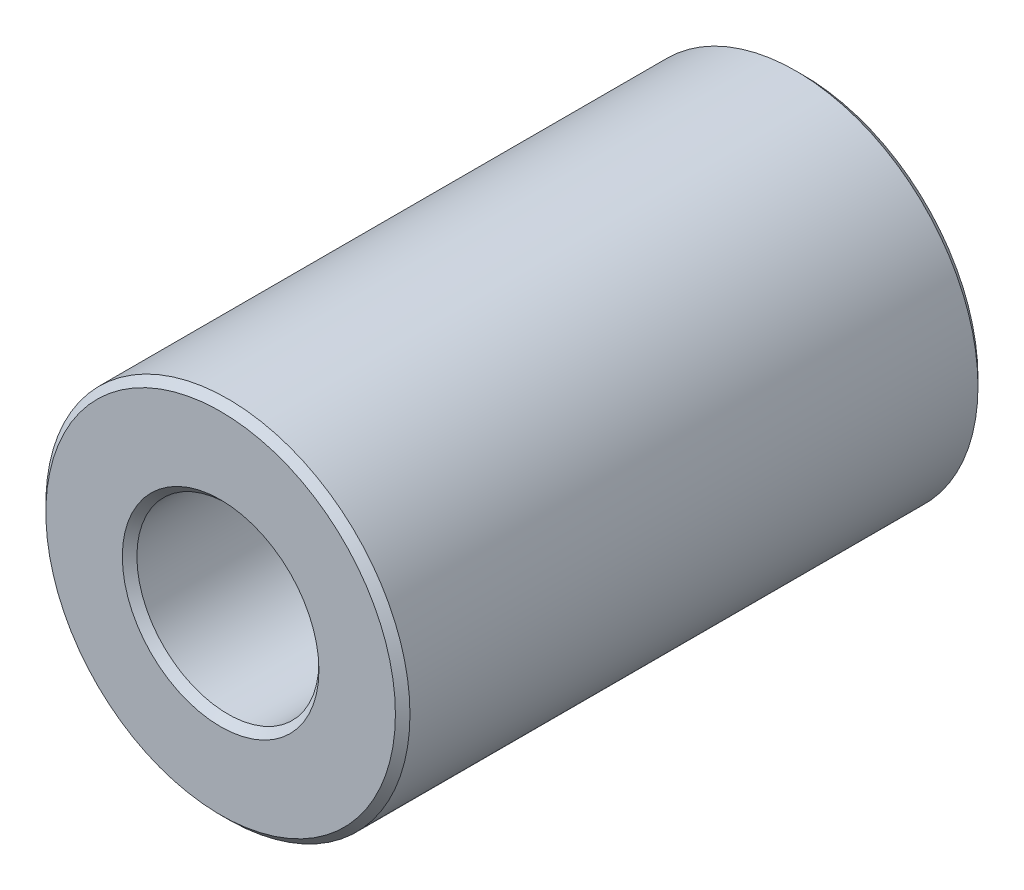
ISO-10303-21;
HEADER;
FILE_DESCRIPTION(('STEP AP214'),'2;1');
FILE_NAME('part.step','',(''),(''),'','','');
FILE_SCHEMA(('AUTOMOTIVE_DESIGN { 1 0 10303 214 1 1 1 1 }'));
ENDSEC;
DATA;
#1=APPLICATION_CONTEXT('core data for automotive mechanical design processes');
#2=APPLICATION_PROTOCOL_DEFINITION('international standard','automotive_design',2000,#1);
#3=PRODUCT_CONTEXT('',#1,'mechanical');
#4=PRODUCT('Part','Part','',(#3));
#5=PRODUCT_RELATED_PRODUCT_CATEGORY('part','',(#4));
#6=PRODUCT_DEFINITION_FORMATION('','',#4);
#7=PRODUCT_DEFINITION_CONTEXT('part definition',#1,'design');
#8=PRODUCT_DEFINITION('design','',#6,#7);
#9=PRODUCT_DEFINITION_SHAPE('','',#8);
#10=(LENGTH_UNIT() NAMED_UNIT(*) SI_UNIT(.MILLI.,.METRE.));
#11=(NAMED_UNIT(*) PLANE_ANGLE_UNIT() SI_UNIT($,.RADIAN.));
#12=(NAMED_UNIT(*) SI_UNIT($,.STERADIAN.) SOLID_ANGLE_UNIT());
#13=UNCERTAINTY_MEASURE_WITH_UNIT(LENGTH_MEASURE(1.E-05),#10,'distance_accuracy_value','');
#14=(GEOMETRIC_REPRESENTATION_CONTEXT(3) GLOBAL_UNCERTAINTY_ASSIGNED_CONTEXT((#13)) GLOBAL_UNIT_ASSIGNED_CONTEXT((#10,
#11,#12)) REPRESENTATION_CONTEXT('',''));
#15=CARTESIAN_POINT('',(0.,0.,0.));
#16=DIRECTION('',(0.,0.,1.));
#17=DIRECTION('',(1.,0.,0.));
#18=AXIS2_PLACEMENT_3D('',#15,#16,#17);
#19=CARTESIAN_POINT('',(0.,0.,4.));
#20=DIRECTION('',(0.,0.,1.));
#21=DIRECTION('',(1.,0.,0.));
#22=AXIS2_PLACEMENT_3D('',#19,#20,#21);
#23=PLANE('',#22);
#24=CARTESIAN_POINT('',(0.,0.,4.));
#25=DIRECTION('',(0.,0.,1.));
#26=DIRECTION('',(1.,0.,0.));
#27=AXIS2_PLACEMENT_3D('',#24,#25,#26);
#28=CIRCLE('',#27,1.35);
#29=CARTESIAN_POINT('',(1.35,0.,4.));
#30=VERTEX_POINT('',#29);
#31=EDGE_CURVE('E10',#30,#30,#28,.F.);
#32=ORIENTED_EDGE('',*,*,#31,.T.);
#33=EDGE_LOOP('',(#32));
#34=FACE_BOUND('',#33,.T.);
#35=CARTESIAN_POINT('',(0.,0.,4.));
#36=DIRECTION('',(0.,0.,1.));
#37=DIRECTION('',(1.,0.,0.));
#38=AXIS2_PLACEMENT_3D('',#35,#36,#37);
#39=CIRCLE('',#38,2.4);
#40=CARTESIAN_POINT('',(2.4,0.,4.));
#41=VERTEX_POINT('',#40);
#42=EDGE_CURVE('E45',#41,#41,#39,.T.);
#43=ORIENTED_EDGE('',*,*,#42,.T.);
#44=EDGE_LOOP('',(#43));
#45=FACE_BOUND('',#44,.T.);
#46=ADVANCED_FACE('F37',(#34,#45),#23,.T.);
#47=CARTESIAN_POINT('',(0.,0.,-4.));
#48=DIRECTION('',(0.,0.,1.));
#49=DIRECTION('',(1.,0.,0.));
#50=AXIS2_PLACEMENT_3D('',#47,#48,#49);
#51=PLANE('',#50);
#52=CARTESIAN_POINT('',(0.,0.,-4.));
#53=DIRECTION('',(0.,0.,1.));
#54=DIRECTION('',(1.,0.,0.));
#55=AXIS2_PLACEMENT_3D('',#52,#53,#54);
#56=CIRCLE('',#55,2.4);
#57=CARTESIAN_POINT('',(2.4,0.,-4.));
#58=VERTEX_POINT('',#57);
#59=EDGE_CURVE('E62',#58,#58,#56,.F.);
#60=ORIENTED_EDGE('',*,*,#59,.T.);
#61=EDGE_LOOP('',(#60));
#62=FACE_BOUND('',#61,.T.);
#63=CARTESIAN_POINT('',(0.,0.,-4.));
#64=DIRECTION('',(0.,0.,1.));
#65=DIRECTION('',(1.,0.,0.));
#66=AXIS2_PLACEMENT_3D('',#63,#64,#65);
#67=CIRCLE('',#66,1.35);
#68=CARTESIAN_POINT('',(1.35,0.,-4.));
#69=VERTEX_POINT('',#68);
#70=EDGE_CURVE('E65',#69,#69,#67,.T.);
#71=ORIENTED_EDGE('',*,*,#70,.T.);
#72=EDGE_LOOP('',(#71));
#73=FACE_BOUND('',#72,.T.);
#74=ADVANCED_FACE('F89',(#62,#73),#51,.F.);
#75=CARTESIAN_POINT('',(0.,0.,4.));
#76=DIRECTION('',(0.,0.,-1.));
#77=DIRECTION('',(-1.,0.,0.));
#78=AXIS2_PLACEMENT_3D('',#75,#76,#77);
#79=CYLINDRICAL_SURFACE('',#78,2.5);
#80=CARTESIAN_POINT('',(0.,0.,-3.9));
#81=DIRECTION('',(0.,0.,1.));
#82=DIRECTION('',(1.,0.,0.));
#83=AXIS2_PLACEMENT_3D('',#80,#81,#82);
#84=CIRCLE('',#83,2.5);
#85=CARTESIAN_POINT('',(2.5,0.,-3.9));
#86=VERTEX_POINT('',#85);
#87=EDGE_CURVE('E69',#86,#86,#84,.T.);
#88=ORIENTED_EDGE('',*,*,#87,.T.);
#89=EDGE_LOOP('',(#88));
#90=FACE_BOUND('',#89,.T.);
#91=CARTESIAN_POINT('',(0.,0.,3.9));
#92=DIRECTION('',(0.,0.,1.));
#93=DIRECTION('',(1.,0.,0.));
#94=AXIS2_PLACEMENT_3D('',#91,#92,#93);
#95=CIRCLE('',#94,2.5);
#96=CARTESIAN_POINT('',(2.5,0.,3.9));
#97=VERTEX_POINT('',#96);
#98=EDGE_CURVE('E73',#97,#97,#95,.F.);
#99=ORIENTED_EDGE('',*,*,#98,.T.);
#100=EDGE_LOOP('',(#99));
#101=FACE_BOUND('',#100,.T.);
#102=ADVANCED_FACE('F78',(#90,#101),#79,.T.);
#103=CARTESIAN_POINT('',(0.,0.,4.));
#104=DIRECTION('',(0.,0.,-1.));
#105=DIRECTION('',(-1.,0.,0.));
#106=AXIS2_PLACEMENT_3D('',#103,#104,#105);
#107=CYLINDRICAL_SURFACE('',#106,1.25);
#108=CARTESIAN_POINT('',(0.,0.,-3.9));
#109=DIRECTION('',(0.,0.,1.));
#110=DIRECTION('',(1.,0.,0.));
#111=AXIS2_PLACEMENT_3D('',#108,#109,#110);
#112=CIRCLE('',#111,1.25);
#113=CARTESIAN_POINT('',(1.25,0.,-3.9));
#114=VERTEX_POINT('',#113);
#115=EDGE_CURVE('E51',#114,#114,#112,.F.);
#116=ORIENTED_EDGE('',*,*,#115,.T.);
#117=EDGE_LOOP('',(#116));
#118=FACE_BOUND('',#117,.T.);
#119=CARTESIAN_POINT('',(0.,0.,3.9));
#120=DIRECTION('',(0.,0.,1.));
#121=DIRECTION('',(1.,0.,0.));
#122=AXIS2_PLACEMENT_3D('',#119,#120,#121);
#123=CIRCLE('',#122,1.25);
#124=CARTESIAN_POINT('',(1.25,0.,3.9));
#125=VERTEX_POINT('',#124);
#126=EDGE_CURVE('E57',#125,#125,#123,.T.);
#127=ORIENTED_EDGE('',*,*,#126,.T.);
#128=EDGE_LOOP('',(#127));
#129=FACE_BOUND('',#128,.T.);
#130=ADVANCED_FACE('F97',(#118,#129),#107,.F.);
#131=CARTESIAN_POINT('',(0.,0.,-3.9));
#132=DIRECTION('',(0.,0.,1.));
#133=DIRECTION('',(1.,0.,0.));
#134=AXIS2_PLACEMENT_3D('',#131,#132,#133);
#135=CONICAL_SURFACE('',#134,2.5,0.785398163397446);
#136=ORIENTED_EDGE('',*,*,#59,.F.);
#137=EDGE_LOOP('',(#136));
#138=FACE_BOUND('',#137,.T.);
#139=ORIENTED_EDGE('',*,*,#87,.F.);
#140=EDGE_LOOP('',(#139));
#141=FACE_BOUND('',#140,.T.);
#142=ADVANCED_FACE('F102',(#138,#141),#135,.T.);
#143=CARTESIAN_POINT('',(0.,0.,-4.));
#144=DIRECTION('',(0.,0.,-1.));
#145=DIRECTION('',(-1.,0.,0.));
#146=AXIS2_PLACEMENT_3D('',#143,#144,#145);
#147=CONICAL_SURFACE('',#146,1.35,0.785398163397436);
#148=ORIENTED_EDGE('',*,*,#115,.F.);
#149=EDGE_LOOP('',(#148));
#150=FACE_BOUND('',#149,.T.);
#151=ORIENTED_EDGE('',*,*,#70,.F.);
#152=EDGE_LOOP('',(#151));
#153=FACE_BOUND('',#152,.T.);
#154=ADVANCED_FACE('F86',(#150,#153),#147,.F.);
#155=CARTESIAN_POINT('',(0.,0.,3.9));
#156=DIRECTION('',(0.,0.,1.));
#157=DIRECTION('',(1.,0.,0.));
#158=AXIS2_PLACEMENT_3D('',#155,#156,#157);
#159=CONICAL_SURFACE('',#158,1.25,0.785398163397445);
#160=ORIENTED_EDGE('',*,*,#31,.F.);
#161=EDGE_LOOP('',(#160));
#162=FACE_BOUND('',#161,.T.);
#163=ORIENTED_EDGE('',*,*,#126,.F.);
#164=EDGE_LOOP('',(#163));
#165=FACE_BOUND('',#164,.T.);
#166=ADVANCED_FACE('F82',(#162,#165),#159,.F.);
#167=CARTESIAN_POINT('',(0.,0.,4.));
#168=DIRECTION('',(0.,0.,-1.));
#169=DIRECTION('',(-1.,0.,0.));
#170=AXIS2_PLACEMENT_3D('',#167,#168,#169);
#171=CONICAL_SURFACE('',#170,2.4,0.785398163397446);
#172=ORIENTED_EDGE('',*,*,#98,.F.);
#173=EDGE_LOOP('',(#172));
#174=FACE_BOUND('',#173,.T.);
#175=ORIENTED_EDGE('',*,*,#42,.F.);
#176=EDGE_LOOP('',(#175));
#177=FACE_BOUND('',#176,.T.);
#178=ADVANCED_FACE('F39',(#174,#177),#171,.T.);
#179=CLOSED_SHELL('',(#46,#74,#102,#130,#142,#154,#166,#178));
#180=MANIFOLD_SOLID_BREP('B2',#179);
#181=ADVANCED_BREP_SHAPE_REPRESENTATION('',(#18,#180),#14);
#182=SHAPE_DEFINITION_REPRESENTATION(#9,#181);
ENDSEC;
END-ISO-10303-21;
